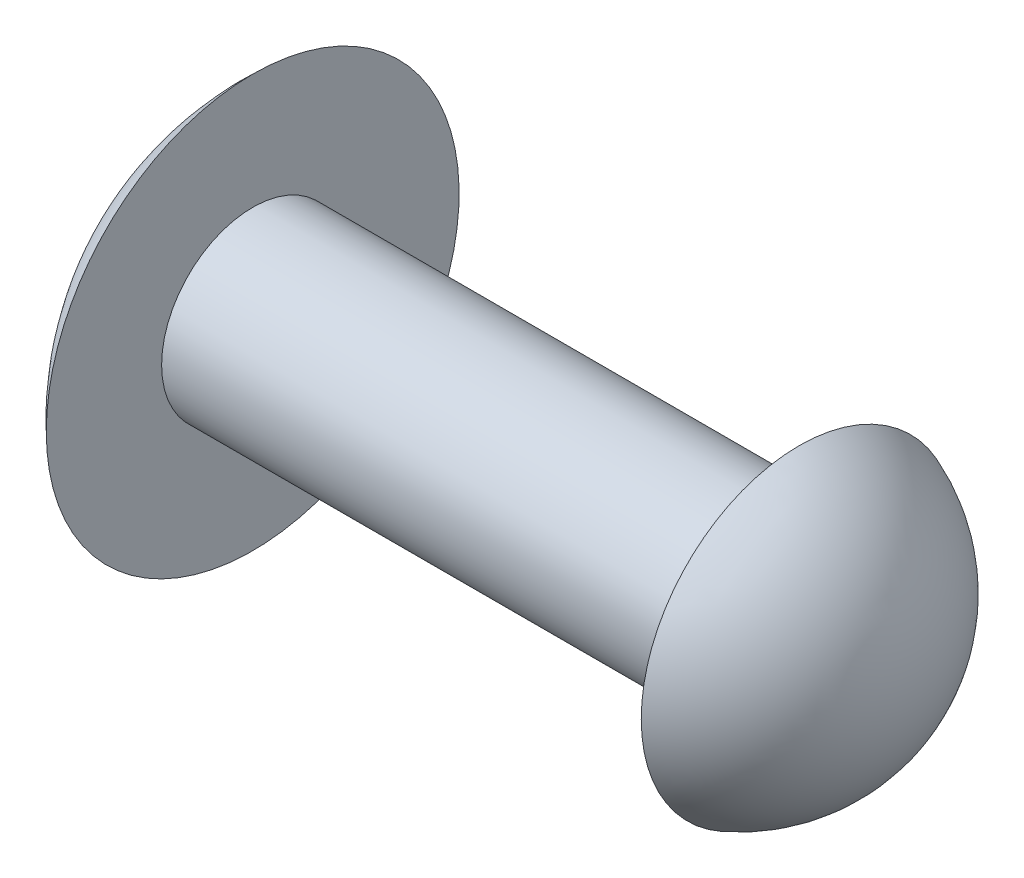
from build123d import *


with BuildPart() as part:
    # Sketch1 → Base-Revolve (revolve)
    with BuildSketch(Plane.XY, mode=Mode.PRIVATE) as base_revolve_sk:
        with BuildLine():
            Line((-10.5, 0), (0, 0))
            Line((0, 0), (0, 1.5))
            Line((0, 1.5), (-9, 1.5))
            Line((-9, 1.5), (-9, 3.4))
            ThreePointArc((-9, 3.4), (-10.10833828, 1.858090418), (-10.5, 0))
        make_face()
    revolve(base_revolve_sk.sketch.rotate(Axis((-39, 0, 0), (1, 0, 0)), 90), axis=Axis((-39, 0, 0), (1, 0, 0)))

    # Sketch2 → HeadTypeA (revolve)
    with BuildSketch(Plane.XY):
        with BuildLine():
            Line((0, 0), (1.8, 0))
            ThreePointArc((1.8, 0), (1.306089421, 1.58113883), (0, 2.6))
            Line((0, 2.6), (0, 0))
        make_face()
    revolve(axis=Axis((-49, 0, 0), (1, 0, 0)))


solid = part.part
